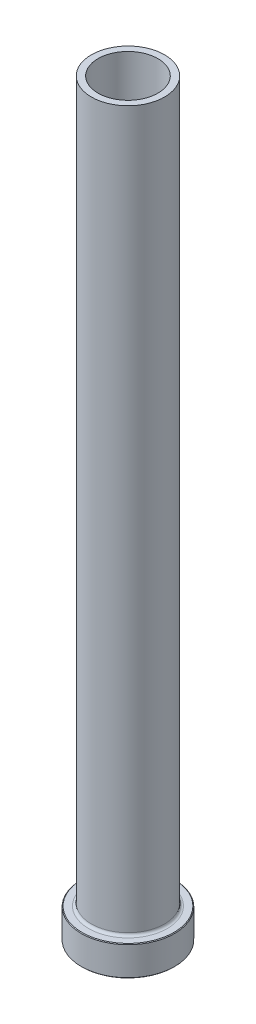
ISO-10303-21;
HEADER;
FILE_DESCRIPTION(('STEP AP214'),'2;1');
FILE_NAME('part.step','',(''),(''),'','','');
FILE_SCHEMA(('AUTOMOTIVE_DESIGN { 1 0 10303 214 1 1 1 1 }'));
ENDSEC;
DATA;
#1=APPLICATION_CONTEXT('core data for automotive mechanical design processes');
#2=APPLICATION_PROTOCOL_DEFINITION('international standard','automotive_design',2000,#1);
#3=PRODUCT_CONTEXT('',#1,'mechanical');
#4=PRODUCT('Part','Part','',(#3));
#5=PRODUCT_RELATED_PRODUCT_CATEGORY('part','',(#4));
#6=PRODUCT_DEFINITION_FORMATION('','',#4);
#7=PRODUCT_DEFINITION_CONTEXT('part definition',#1,'design');
#8=PRODUCT_DEFINITION('design','',#6,#7);
#9=PRODUCT_DEFINITION_SHAPE('','',#8);
#10=(LENGTH_UNIT() NAMED_UNIT(*) SI_UNIT(.MILLI.,.METRE.));
#11=(NAMED_UNIT(*) PLANE_ANGLE_UNIT() SI_UNIT($,.RADIAN.));
#12=(NAMED_UNIT(*) SI_UNIT($,.STERADIAN.) SOLID_ANGLE_UNIT());
#13=UNCERTAINTY_MEASURE_WITH_UNIT(LENGTH_MEASURE(1.E-05),#10,'distance_accuracy_value','');
#14=(GEOMETRIC_REPRESENTATION_CONTEXT(3) GLOBAL_UNCERTAINTY_ASSIGNED_CONTEXT((#13)) GLOBAL_UNIT_ASSIGNED_CONTEXT((#10,
#11,#12)) REPRESENTATION_CONTEXT('',''));
#15=CARTESIAN_POINT('',(0.,0.,0.));
#16=DIRECTION('',(0.,0.,1.));
#17=DIRECTION('',(1.,0.,0.));
#18=AXIS2_PLACEMENT_3D('',#15,#16,#17);
#19=CARTESIAN_POINT('',(0.,92.1876809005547,0.));
#20=DIRECTION('',(0.,1.,0.));
#21=DIRECTION('',(0.,0.,1.));
#22=AXIS2_PLACEMENT_3D('',#19,#20,#21);
#23=CYLINDRICAL_SURFACE('',#22,9.00000000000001);
#24=CARTESIAN_POINT('',(0.,225.,0.));
#25=DIRECTION('',(0.,1.,0.));
#26=DIRECTION('',(0.,0.,1.));
#27=AXIS2_PLACEMENT_3D('',#24,#25,#26);
#28=CIRCLE('',#27,9.00000000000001);
#29=CARTESIAN_POINT('',(0.,225.,9.00000000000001));
#30=VERTEX_POINT('',#29);
#31=EDGE_CURVE('E62',#30,#30,#28,.T.);
#32=ORIENTED_EDGE('',*,*,#31,.T.);
#33=EDGE_LOOP('',(#32));
#34=FACE_BOUND('',#33,.T.);
#35=CARTESIAN_POINT('',(0.,170.,0.));
#36=DIRECTION('',(0.,1.,0.));
#37=DIRECTION('',(0.,0.,1.));
#38=AXIS2_PLACEMENT_3D('',#35,#36,#37);
#39=CIRCLE('',#38,9.00000000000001);
#40=CARTESIAN_POINT('',(0.,170.,9.00000000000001));
#41=VERTEX_POINT('',#40);
#42=EDGE_CURVE('E71',#41,#41,#39,.T.);
#43=ORIENTED_EDGE('',*,*,#42,.F.);
#44=EDGE_LOOP('',(#43));
#45=FACE_BOUND('',#44,.T.);
#46=ADVANCED_FACE('F30',(#34,#45),#23,.F.);
#47=CARTESIAN_POINT('',(-9.00000000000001,225.,0.));
#48=DIRECTION('',(0.,1.,0.));
#49=DIRECTION('',(0.,0.,1.));
#50=AXIS2_PLACEMENT_3D('',#47,#48,#49);
#51=PLANE('',#50);
#52=CARTESIAN_POINT('',(0.,225.,0.));
#53=DIRECTION('',(0.,1.,0.));
#54=DIRECTION('',(0.,0.,1.));
#55=AXIS2_PLACEMENT_3D('',#52,#53,#54);
#56=CIRCLE('',#55,11.);
#57=CARTESIAN_POINT('',(0.,225.,11.));
#58=VERTEX_POINT('',#57);
#59=EDGE_CURVE('E65',#58,#58,#56,.T.);
#60=ORIENTED_EDGE('',*,*,#59,.T.);
#61=EDGE_LOOP('',(#60));
#62=FACE_BOUND('',#61,.T.);
#63=ORIENTED_EDGE('',*,*,#31,.F.);
#64=EDGE_LOOP('',(#63));
#65=FACE_BOUND('',#64,.T.);
#66=ADVANCED_FACE('F79',(#62,#65),#51,.T.);
#67=CARTESIAN_POINT('',(0.,92.1876809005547,0.));
#68=DIRECTION('',(0.,1.,0.));
#69=DIRECTION('',(0.,0.,1.));
#70=AXIS2_PLACEMENT_3D('',#67,#68,#69);
#71=CYLINDRICAL_SURFACE('',#70,11.);
#72=CARTESIAN_POINT('',(0.,9.8,0.));
#73=DIRECTION('',(0.,1.,0.));
#74=DIRECTION('',(0.,0.,1.));
#75=AXIS2_PLACEMENT_3D('',#72,#73,#74);
#76=CIRCLE('',#75,11.);
#77=CARTESIAN_POINT('',(0.,9.8,11.));
#78=VERTEX_POINT('',#77);
#79=EDGE_CURVE('E59',#78,#78,#76,.T.);
#80=ORIENTED_EDGE('',*,*,#79,.T.);
#81=EDGE_LOOP('',(#80));
#82=FACE_BOUND('',#81,.T.);
#83=ORIENTED_EDGE('',*,*,#59,.F.);
#84=EDGE_LOOP('',(#83));
#85=FACE_BOUND('',#84,.T.);
#86=ADVANCED_FACE('F85',(#82,#85),#71,.T.);
#87=CARTESIAN_POINT('',(-11.,9.,0.));
#88=DIRECTION('',(0.,1.,0.));
#89=DIRECTION('',(0.,0.,1.));
#90=AXIS2_PLACEMENT_3D('',#87,#88,#89);
#91=PLANE('',#90);
#92=CARTESIAN_POINT('',(0.,9.,0.));
#93=DIRECTION('',(0.,1.,0.));
#94=DIRECTION('',(0.,0.,1.));
#95=AXIS2_PLACEMENT_3D('',#92,#93,#94);
#96=CIRCLE('',#95,13.8);
#97=CARTESIAN_POINT('',(0.,9.,13.8));
#98=VERTEX_POINT('',#97);
#99=EDGE_CURVE('E53',#98,#98,#96,.T.);
#100=ORIENTED_EDGE('',*,*,#99,.T.);
#101=EDGE_LOOP('',(#100));
#102=FACE_BOUND('',#101,.T.);
#103=CARTESIAN_POINT('',(0.,9.,0.));
#104=DIRECTION('',(0.,1.,0.));
#105=DIRECTION('',(0.,0.,1.));
#106=AXIS2_PLACEMENT_3D('',#103,#104,#105);
#107=CIRCLE('',#106,11.8);
#108=CARTESIAN_POINT('',(0.,9.,11.8));
#109=VERTEX_POINT('',#108);
#110=EDGE_CURVE('E56',#109,#109,#107,.F.);
#111=ORIENTED_EDGE('',*,*,#110,.T.);
#112=EDGE_LOOP('',(#111));
#113=FACE_BOUND('',#112,.T.);
#114=ADVANCED_FACE('F111',(#102,#113),#91,.T.);
#115=CARTESIAN_POINT('',(0.,92.1876809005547,0.));
#116=DIRECTION('',(0.,1.,0.));
#117=DIRECTION('',(0.,0.,1.));
#118=AXIS2_PLACEMENT_3D('',#115,#116,#117);
#119=CYLINDRICAL_SURFACE('',#118,14.);
#120=CARTESIAN_POINT('',(0.,8.8,0.));
#121=DIRECTION('',(0.,1.,0.));
#122=DIRECTION('',(0.,0.,1.));
#123=AXIS2_PLACEMENT_3D('',#120,#121,#122);
#124=CIRCLE('',#123,14.);
#125=CARTESIAN_POINT('',(0.,8.8,14.));
#126=VERTEX_POINT('',#125);
#127=EDGE_CURVE('E45',#126,#126,#124,.F.);
#128=ORIENTED_EDGE('',*,*,#127,.T.);
#129=EDGE_LOOP('',(#128));
#130=FACE_BOUND('',#129,.T.);
#131=CARTESIAN_POINT('',(0.,0.199999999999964,0.));
#132=DIRECTION('',(0.,-1.,0.));
#133=DIRECTION('',(0.,0.,-1.));
#134=AXIS2_PLACEMENT_3D('',#131,#132,#133);
#135=CIRCLE('',#134,14.);
#136=CARTESIAN_POINT('',(0.,0.199999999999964,-14.));
#137=VERTEX_POINT('',#136);
#138=EDGE_CURVE('E50',#137,#137,#135,.F.);
#139=ORIENTED_EDGE('',*,*,#138,.T.);
#140=EDGE_LOOP('',(#139));
#141=FACE_BOUND('',#140,.T.);
#142=ADVANCED_FACE('F108',(#130,#141),#119,.T.);
#143=CARTESIAN_POINT('',(-14.,0.,0.));
#144=DIRECTION('',(0.,-1.,0.));
#145=DIRECTION('',(0.,0.,-1.));
#146=AXIS2_PLACEMENT_3D('',#143,#144,#145);
#147=PLANE('',#146);
#148=CARTESIAN_POINT('',(0.,0.,0.));
#149=DIRECTION('',(0.,-1.,0.));
#150=DIRECTION('',(0.,0.,-1.));
#151=AXIS2_PLACEMENT_3D('',#148,#149,#150);
#152=CIRCLE('',#151,9.74999999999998);
#153=CARTESIAN_POINT('',(0.,0.,-9.74999999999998));
#154=VERTEX_POINT('',#153);
#155=EDGE_CURVE('E37',#154,#154,#152,.F.);
#156=ORIENTED_EDGE('',*,*,#155,.T.);
#157=EDGE_LOOP('',(#156));
#158=FACE_BOUND('',#157,.T.);
#159=CARTESIAN_POINT('',(0.,0.,0.));
#160=DIRECTION('',(0.,-1.,0.));
#161=DIRECTION('',(0.,0.,-1.));
#162=AXIS2_PLACEMENT_3D('',#159,#160,#161);
#163=CIRCLE('',#162,13.8);
#164=CARTESIAN_POINT('',(0.,0.,-13.8));
#165=VERTEX_POINT('',#164);
#166=EDGE_CURVE('E41',#165,#165,#163,.T.);
#167=ORIENTED_EDGE('',*,*,#166,.T.);
#168=EDGE_LOOP('',(#167));
#169=FACE_BOUND('',#168,.T.);
#170=ADVANCED_FACE('F110',(#158,#169),#147,.T.);
#171=CARTESIAN_POINT('',(0.,92.1876809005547,0.));
#172=DIRECTION('',(0.,1.,0.));
#173=DIRECTION('',(0.,0.,1.));
#174=AXIS2_PLACEMENT_3D('',#171,#172,#173);
#175=CYLINDRICAL_SURFACE('',#174,9.25);
#176=CARTESIAN_POINT('',(0.,0.499999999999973,0.));
#177=DIRECTION('',(0.,-1.,0.));
#178=DIRECTION('',(0.,0.,-1.));
#179=AXIS2_PLACEMENT_3D('',#176,#177,#178);
#180=CIRCLE('',#179,9.25);
#181=CARTESIAN_POINT('',(0.,0.499999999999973,-9.25));
#182=VERTEX_POINT('',#181);
#183=EDGE_CURVE('E10',#182,#182,#180,.T.);
#184=ORIENTED_EDGE('',*,*,#183,.T.);
#185=EDGE_LOOP('',(#184));
#186=FACE_BOUND('',#185,.T.);
#187=CARTESIAN_POINT('',(0.,158.,0.));
#188=DIRECTION('',(0.,1.,0.));
#189=DIRECTION('',(0.,0.,1.));
#190=AXIS2_PLACEMENT_3D('',#187,#188,#189);
#191=CIRCLE('',#190,9.25000000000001);
#192=CARTESIAN_POINT('',(0.,158.,9.25000000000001));
#193=VERTEX_POINT('',#192);
#194=EDGE_CURVE('E68',#193,#193,#191,.T.);
#195=ORIENTED_EDGE('',*,*,#194,.T.);
#196=EDGE_LOOP('',(#195));
#197=FACE_BOUND('',#196,.T.);
#198=ADVANCED_FACE('F118',(#186,#197),#175,.F.);
#199=CARTESIAN_POINT('',(0.,158.,0.));
#200=DIRECTION('',(0.,-1.,0.));
#201=DIRECTION('',(0.,0.,-1.));
#202=AXIS2_PLACEMENT_3D('',#199,#200,#201);
#203=CONICAL_SURFACE('',#202,9.25000000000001,0.0208303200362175);
#204=ORIENTED_EDGE('',*,*,#42,.T.);
#205=EDGE_LOOP('',(#204));
#206=FACE_BOUND('',#205,.T.);
#207=ORIENTED_EDGE('',*,*,#194,.F.);
#208=EDGE_LOOP('',(#207));
#209=FACE_BOUND('',#208,.T.);
#210=ADVANCED_FACE('F75',(#206,#209),#203,.F.);
#211=CARTESIAN_POINT('',(0.,9.8,0.));
#212=DIRECTION('',(0.,1.,0.));
#213=DIRECTION('',(0.,0.,1.));
#214=AXIS2_PLACEMENT_3D('',#211,#212,#213);
#215=TOROIDAL_SURFACE('',#214,11.8,0.8);
#216=ORIENTED_EDGE('',*,*,#110,.F.);
#217=EDGE_LOOP('',(#216));
#218=FACE_BOUND('',#217,.T.);
#219=ORIENTED_EDGE('',*,*,#79,.F.);
#220=EDGE_LOOP('',(#219));
#221=FACE_BOUND('',#220,.T.);
#222=ADVANCED_FACE('F90',(#218,#221),#215,.F.);
#223=CARTESIAN_POINT('',(0.,8.99999999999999,0.));
#224=DIRECTION('',(0.,-1.,0.));
#225=DIRECTION('',(0.,0.,-1.));
#226=AXIS2_PLACEMENT_3D('',#223,#224,#225);
#227=CONICAL_SURFACE('',#226,13.8,0.785398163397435);
#228=ORIENTED_EDGE('',*,*,#127,.F.);
#229=EDGE_LOOP('',(#228));
#230=FACE_BOUND('',#229,.T.);
#231=ORIENTED_EDGE('',*,*,#99,.F.);
#232=EDGE_LOOP('',(#231));
#233=FACE_BOUND('',#232,.T.);
#234=ADVANCED_FACE('F93',(#230,#233),#227,.T.);
#235=CARTESIAN_POINT('',(0.,0.199999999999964,0.));
#236=DIRECTION('',(0.,1.,0.));
#237=DIRECTION('',(0.,0.,1.));
#238=AXIS2_PLACEMENT_3D('',#235,#236,#237);
#239=CONICAL_SURFACE('',#238,14.,0.785398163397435);
#240=ORIENTED_EDGE('',*,*,#166,.F.);
#241=EDGE_LOOP('',(#240));
#242=FACE_BOUND('',#241,.T.);
#243=ORIENTED_EDGE('',*,*,#138,.F.);
#244=EDGE_LOOP('',(#243));
#245=FACE_BOUND('',#244,.T.);
#246=ADVANCED_FACE('F96',(#242,#245),#239,.T.);
#247=CARTESIAN_POINT('',(0.,0.,0.));
#248=DIRECTION('',(0.,-1.,0.));
#249=DIRECTION('',(0.,0.,-1.));
#250=AXIS2_PLACEMENT_3D('',#247,#248,#249);
#251=CONICAL_SURFACE('',#250,9.74999999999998,0.785398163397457);
#252=ORIENTED_EDGE('',*,*,#183,.F.);
#253=EDGE_LOOP('',(#252));
#254=FACE_BOUND('',#253,.T.);
#255=ORIENTED_EDGE('',*,*,#155,.F.);
#256=EDGE_LOOP('',(#255));
#257=FACE_BOUND('',#256,.T.);
#258=ADVANCED_FACE('F32',(#254,#257),#251,.F.);
#259=CLOSED_SHELL('',(#46,#66,#86,#114,#142,#170,#198,#210,#222,#234,#246,#258));
#260=MANIFOLD_SOLID_BREP('B2',#259);
#261=ADVANCED_BREP_SHAPE_REPRESENTATION('',(#18,#260),#14);
#262=SHAPE_DEFINITION_REPRESENTATION(#9,#261);
ENDSEC;
END-ISO-10303-21;
